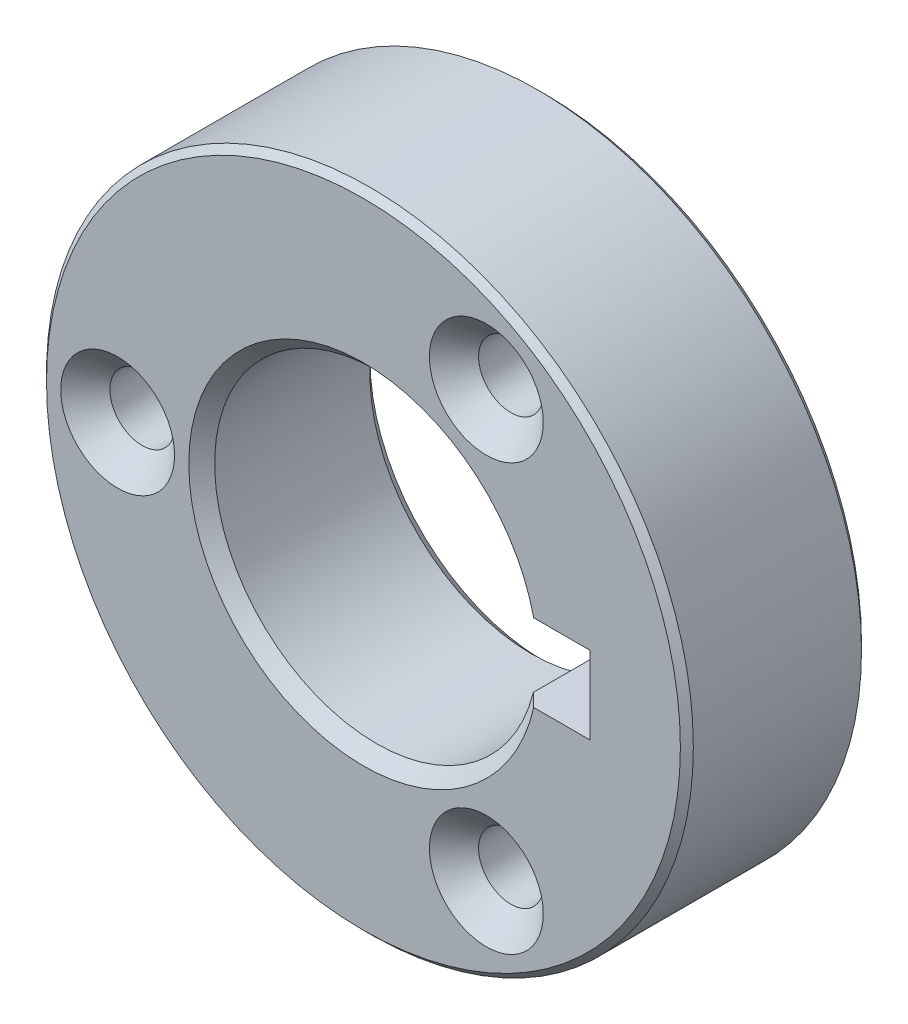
ISO-10303-21;
HEADER;
FILE_DESCRIPTION(('STEP AP214'),'2;1');
FILE_NAME('part.step','',(''),(''),'','','');
FILE_SCHEMA(('AUTOMOTIVE_DESIGN { 1 0 10303 214 1 1 1 1 }'));
ENDSEC;
DATA;
#1=APPLICATION_CONTEXT('core data for automotive mechanical design processes');
#2=APPLICATION_PROTOCOL_DEFINITION('international standard','automotive_design',2000,#1);
#3=PRODUCT_CONTEXT('',#1,'mechanical');
#4=PRODUCT('Part','Part','',(#3));
#5=PRODUCT_RELATED_PRODUCT_CATEGORY('part','',(#4));
#6=PRODUCT_DEFINITION_FORMATION('','',#4);
#7=PRODUCT_DEFINITION_CONTEXT('part definition',#1,'design');
#8=PRODUCT_DEFINITION('design','',#6,#7);
#9=PRODUCT_DEFINITION_SHAPE('','',#8);
#10=(LENGTH_UNIT() NAMED_UNIT(*) SI_UNIT(.MILLI.,.METRE.));
#11=(NAMED_UNIT(*) PLANE_ANGLE_UNIT() SI_UNIT($,.RADIAN.));
#12=(NAMED_UNIT(*) SI_UNIT($,.STERADIAN.) SOLID_ANGLE_UNIT());
#13=UNCERTAINTY_MEASURE_WITH_UNIT(LENGTH_MEASURE(1.E-05),#10,'distance_accuracy_value','');
#14=(GEOMETRIC_REPRESENTATION_CONTEXT(3) GLOBAL_UNCERTAINTY_ASSIGNED_CONTEXT((#13)) GLOBAL_UNIT_ASSIGNED_CONTEXT((#10,
#11,#12)) REPRESENTATION_CONTEXT('',''));
#15=CARTESIAN_POINT('',(0.,0.,0.));
#16=DIRECTION('',(0.,0.,1.));
#17=DIRECTION('',(1.,0.,0.));
#18=AXIS2_PLACEMENT_3D('',#15,#16,#17);
#19=CARTESIAN_POINT('',(0.,0.,14.));
#20=DIRECTION('',(0.,0.,1.));
#21=DIRECTION('',(1.,0.,0.));
#22=AXIS2_PLACEMENT_3D('',#19,#20,#21);
#23=PLANE('',#22);
#24=CARTESIAN_POINT('',(-19.,0.,14.0000000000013));
#25=DIRECTION('',(0.,0.,1.));
#26=DIRECTION('',(1.,0.,0.));
#27=AXIS2_PLACEMENT_3D('',#24,#25,#26);
#28=CIRCLE('',#27,4.4);
#29=CARTESIAN_POINT('',(-14.6,0.,14.0000000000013));
#30=VERTEX_POINT('',#29);
#31=EDGE_CURVE('E113',#30,#30,#28,.T.);
#32=ORIENTED_EDGE('',*,*,#31,.F.);
#33=EDGE_LOOP('',(#32));
#34=FACE_BOUND('',#33,.T.);
#35=CARTESIAN_POINT('',(9.50000000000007,16.4544826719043,14.));
#36=DIRECTION('',(0.,0.,1.));
#37=DIRECTION('',(1.,0.,0.));
#38=AXIS2_PLACEMENT_3D('',#35,#36,#37);
#39=CIRCLE('',#38,4.4);
#40=CARTESIAN_POINT('',(13.9000000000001,16.4544826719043,14.));
#41=VERTEX_POINT('',#40);
#42=EDGE_CURVE('E106',#41,#41,#39,.T.);
#43=ORIENTED_EDGE('',*,*,#42,.F.);
#44=EDGE_LOOP('',(#43));
#45=FACE_BOUND('',#44,.T.);
#46=CARTESIAN_POINT('',(9.49999999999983,-16.4544826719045,14.));
#47=DIRECTION('',(0.,0.,1.));
#48=DIRECTION('',(1.,0.,0.));
#49=AXIS2_PLACEMENT_3D('',#46,#47,#48);
#50=CIRCLE('',#49,4.4);
#51=CARTESIAN_POINT('',(13.8999999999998,-16.4544826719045,14.));
#52=VERTEX_POINT('',#51);
#53=EDGE_CURVE('E122',#52,#52,#50,.T.);
#54=ORIENTED_EDGE('',*,*,#53,.F.);
#55=EDGE_LOOP('',(#54));
#56=FACE_BOUND('',#55,.T.);
#57=CARTESIAN_POINT('',(0.,0.,14.));
#58=DIRECTION('',(0.,0.,1.));
#59=DIRECTION('',(1.,0.,0.));
#60=AXIS2_PLACEMENT_3D('',#57,#58,#59);
#61=CIRCLE('',#60,24.5);
#62=CARTESIAN_POINT('',(24.5,0.,14.));
#63=VERTEX_POINT('',#62);
#64=EDGE_CURVE('E164',#63,#63,#61,.T.);
#65=ORIENTED_EDGE('',*,*,#64,.T.);
#66=EDGE_LOOP('',(#65));
#67=FACE_BOUND('',#66,.T.);
#68=DIRECTION('',(1.,0.,0.));
#69=VECTOR('',#68,1.);
#70=CARTESIAN_POINT('',(12.1346610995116,-3.,14.));
#71=LINE('',#70,#69);
#72=CARTESIAN_POINT('',(13.1624465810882,-3.,14.));
#73=VERTEX_POINT('',#72);
#74=CARTESIAN_POINT('',(17.5,-3.,14.));
#75=VERTEX_POINT('',#74);
#76=EDGE_CURVE('E138',#73,#75,#71,.T.);
#77=ORIENTED_EDGE('',*,*,#76,.F.);
#78=CARTESIAN_POINT('',(0.,0.,14.));
#79=DIRECTION('',(0.,0.,1.));
#80=DIRECTION('',(1.,0.,0.));
#81=AXIS2_PLACEMENT_3D('',#78,#79,#80);
#82=CIRCLE('',#81,13.5);
#83=CARTESIAN_POINT('',(13.1624465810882,3.,14.));
#84=VERTEX_POINT('',#83);
#85=EDGE_CURVE('E55',#73,#84,#82,.F.);
#86=ORIENTED_EDGE('',*,*,#85,.T.);
#87=DIRECTION('',(-1.,0.,0.));
#88=VECTOR('',#87,1.);
#89=CARTESIAN_POINT('',(12.1346610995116,3.,14.));
#90=LINE('',#89,#88);
#91=CARTESIAN_POINT('',(17.5,3.,14.));
#92=VERTEX_POINT('',#91);
#93=EDGE_CURVE('E143',#92,#84,#90,.T.);
#94=ORIENTED_EDGE('',*,*,#93,.F.);
#95=DIRECTION('',(0.,1.,0.));
#96=VECTOR('',#95,1.);
#97=CARTESIAN_POINT('',(17.5,3.,14.));
#98=LINE('',#97,#96);
#99=EDGE_CURVE('E140',#75,#92,#98,.T.);
#100=ORIENTED_EDGE('',*,*,#99,.F.);
#101=EDGE_LOOP('',(#77,#86,#94,#100));
#102=FACE_BOUND('',#101,.T.);
#103=ADVANCED_FACE('F32',(#34,#45,#56,#67,#102),#23,.T.);
#104=CARTESIAN_POINT('',(0.,0.,0.));
#105=DIRECTION('',(0.,0.,1.));
#106=DIRECTION('',(1.,0.,0.));
#107=AXIS2_PLACEMENT_3D('',#104,#105,#106);
#108=PLANE('',#107);
#109=CARTESIAN_POINT('',(0.,0.,0.));
#110=DIRECTION('',(0.,0.,1.));
#111=DIRECTION('',(1.,0.,0.));
#112=AXIS2_PLACEMENT_3D('',#109,#110,#111);
#113=CIRCLE('',#112,24.5);
#114=CARTESIAN_POINT('',(24.5,0.,0.));
#115=VERTEX_POINT('',#114);
#116=EDGE_CURVE('E161',#115,#115,#113,.F.);
#117=ORIENTED_EDGE('',*,*,#116,.T.);
#118=EDGE_LOOP('',(#117));
#119=FACE_BOUND('',#118,.T.);
#120=DIRECTION('',(-1.,0.,0.));
#121=VECTOR('',#120,1.);
#122=CARTESIAN_POINT('',(12.1346610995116,3.,0.));
#123=LINE('',#122,#121);
#124=CARTESIAN_POINT('',(17.5,3.,0.));
#125=VERTEX_POINT('',#124);
#126=CARTESIAN_POINT('',(13.1624465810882,3.,0.));
#127=VERTEX_POINT('',#126);
#128=EDGE_CURVE('E136',#125,#127,#123,.T.);
#129=ORIENTED_EDGE('',*,*,#128,.T.);
#130=CARTESIAN_POINT('',(0.,0.,0.));
#131=DIRECTION('',(0.,0.,1.));
#132=DIRECTION('',(1.,0.,0.));
#133=AXIS2_PLACEMENT_3D('',#130,#131,#132);
#134=CIRCLE('',#133,13.5);
#135=CARTESIAN_POINT('',(13.1624465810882,-3.,0.));
#136=VERTEX_POINT('',#135);
#137=EDGE_CURVE('E11',#127,#136,#134,.T.);
#138=ORIENTED_EDGE('',*,*,#137,.T.);
#139=DIRECTION('',(1.,0.,0.));
#140=VECTOR('',#139,1.);
#141=CARTESIAN_POINT('',(12.1346610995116,-3.00000000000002,0.));
#142=LINE('',#141,#140);
#143=CARTESIAN_POINT('',(17.5,-3.,0.));
#144=VERTEX_POINT('',#143);
#145=EDGE_CURVE('E131',#136,#144,#142,.T.);
#146=ORIENTED_EDGE('',*,*,#145,.T.);
#147=DIRECTION('',(0.,1.,0.));
#148=VECTOR('',#147,1.);
#149=CARTESIAN_POINT('',(17.5,3.,0.));
#150=LINE('',#149,#148);
#151=EDGE_CURVE('E133',#144,#125,#150,.T.);
#152=ORIENTED_EDGE('',*,*,#151,.T.);
#153=EDGE_LOOP('',(#129,#138,#146,#152));
#154=FACE_BOUND('',#153,.T.);
#155=ADVANCED_FACE('F224',(#119,#154),#108,.F.);
#156=CARTESIAN_POINT('',(0.,0.,14.));
#157=DIRECTION('',(0.,0.,-1.));
#158=DIRECTION('',(-1.,0.,0.));
#159=AXIS2_PLACEMENT_3D('',#156,#157,#158);
#160=CYLINDRICAL_SURFACE('',#159,25.);
#161=CARTESIAN_POINT('',(0.,0.,0.5));
#162=DIRECTION('',(0.,0.,1.));
#163=DIRECTION('',(1.,0.,0.));
#164=AXIS2_PLACEMENT_3D('',#161,#162,#163);
#165=CIRCLE('',#164,25.);
#166=CARTESIAN_POINT('',(25.,0.,0.5));
#167=VERTEX_POINT('',#166);
#168=EDGE_CURVE('E158',#167,#167,#165,.T.);
#169=ORIENTED_EDGE('',*,*,#168,.T.);
#170=EDGE_LOOP('',(#169));
#171=FACE_BOUND('',#170,.T.);
#172=CARTESIAN_POINT('',(0.,0.,13.5));
#173=DIRECTION('',(0.,0.,1.));
#174=DIRECTION('',(1.,0.,0.));
#175=AXIS2_PLACEMENT_3D('',#172,#173,#174);
#176=CIRCLE('',#175,25.);
#177=CARTESIAN_POINT('',(25.,0.,13.5));
#178=VERTEX_POINT('',#177);
#179=EDGE_CURVE('E155',#178,#178,#176,.F.);
#180=ORIENTED_EDGE('',*,*,#179,.T.);
#181=EDGE_LOOP('',(#180));
#182=FACE_BOUND('',#181,.T.);
#183=ADVANCED_FACE('F34',(#171,#182),#160,.T.);
#184=CARTESIAN_POINT('',(0.,0.,14.));
#185=DIRECTION('',(0.,0.,-1.));
#186=DIRECTION('',(-1.,0.,0.));
#187=AXIS2_PLACEMENT_3D('',#184,#185,#186);
#188=CYLINDRICAL_SURFACE('',#187,12.5);
#189=DIRECTION('',(0.,0.,-1.));
#190=VECTOR('',#189,1.);
#191=CARTESIAN_POINT('',(12.1346610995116,3.,14.));
#192=LINE('',#191,#190);
#193=CARTESIAN_POINT('',(12.1346610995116,3.,13.));
#194=VERTEX_POINT('',#193);
#195=CARTESIAN_POINT('',(12.1346610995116,3.,1.));
#196=VERTEX_POINT('',#195);
#197=EDGE_CURVE('E145',#194,#196,#192,.T.);
#198=ORIENTED_EDGE('',*,*,#197,.F.);
#199=CARTESIAN_POINT('',(0.,0.,13.));
#200=DIRECTION('',(0.,0.,1.));
#201=DIRECTION('',(1.,0.,0.));
#202=AXIS2_PLACEMENT_3D('',#199,#200,#201);
#203=CIRCLE('',#202,12.5);
#204=CARTESIAN_POINT('',(12.1346610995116,-3.00000000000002,13.));
#205=VERTEX_POINT('',#204);
#206=EDGE_CURVE('E169',#194,#205,#203,.T.);
#207=ORIENTED_EDGE('',*,*,#206,.T.);
#208=DIRECTION('',(0.,0.,-1.));
#209=VECTOR('',#208,1.);
#210=CARTESIAN_POINT('',(12.1346610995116,-3.,14.));
#211=LINE('',#210,#209);
#212=CARTESIAN_POINT('',(12.1346610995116,-3.00000000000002,1.));
#213=VERTEX_POINT('',#212);
#214=EDGE_CURVE('E152',#205,#213,#211,.T.);
#215=ORIENTED_EDGE('',*,*,#214,.T.);
#216=CARTESIAN_POINT('',(0.,0.,1.));
#217=DIRECTION('',(0.,0.,1.));
#218=DIRECTION('',(1.,0.,0.));
#219=AXIS2_PLACEMENT_3D('',#216,#217,#218);
#220=CIRCLE('',#219,12.5);
#221=EDGE_CURVE('E167',#213,#196,#220,.F.);
#222=ORIENTED_EDGE('',*,*,#221,.T.);
#223=EDGE_LOOP('',(#198,#207,#215,#222));
#224=FACE_BOUND('',#223,.T.);
#225=ADVANCED_FACE('F220',(#224),#188,.F.);
#226=CARTESIAN_POINT('',(12.1346610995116,-3.,14.));
#227=DIRECTION('',(0.,1.,0.));
#228=DIRECTION('',(0.,0.,1.));
#229=AXIS2_PLACEMENT_3D('',#226,#227,#228);
#230=PLANE('',#229);
#231=ORIENTED_EDGE('',*,*,#214,.F.);
#232=CARTESIAN_POINT('',(12.1346610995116,-3.00000000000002,13.));
#233=CARTESIAN_POINT('',(12.3061392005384,-3.00000000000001,13.1664811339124));
#234=CARTESIAN_POINT('',(12.4775270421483,-3.,13.3330550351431));
#235=CARTESIAN_POINT('',(12.8201222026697,-3.,13.6663883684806));
#236=CARTESIAN_POINT('',(12.9913295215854,-3.,13.8331478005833));
#237=CARTESIAN_POINT('',(13.1624465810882,-3.,14.));
#238=B_SPLINE_CURVE_WITH_KNOTS('',3,(#232,#233,#234,#235,#236,#237),.UNSPECIFIED.,.F.,.F.,(4,2,
4),(0.,0.71699784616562,1.43399567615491),.UNSPECIFIED.);
#239=EDGE_CURVE('E179',#205,#73,#238,.T.);
#240=ORIENTED_EDGE('',*,*,#239,.T.);
#241=ORIENTED_EDGE('',*,*,#76,.T.);
#242=DIRECTION('',(0.,0.,-1.));
#243=VECTOR('',#242,1.);
#244=CARTESIAN_POINT('',(17.5,-3.,14.));
#245=LINE('',#244,#243);
#246=EDGE_CURVE('E149',#75,#144,#245,.T.);
#247=ORIENTED_EDGE('',*,*,#246,.T.);
#248=ORIENTED_EDGE('',*,*,#145,.F.);
#249=CARTESIAN_POINT('',(13.1624465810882,-3.,0.));
#250=CARTESIAN_POINT('',(12.9913295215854,-3.,0.166852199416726));
#251=CARTESIAN_POINT('',(12.8201222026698,-3.,0.333611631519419));
#252=CARTESIAN_POINT('',(12.4775270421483,-3.,0.666944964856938));
#253=CARTESIAN_POINT('',(12.3061392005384,-3.00000000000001,0.833518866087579));
#254=CARTESIAN_POINT('',(12.1346610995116,-3.00000000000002,1.));
#255=B_SPLINE_CURVE_WITH_KNOTS('',3,(#249,#250,#251,#252,#253,#254),.UNSPECIFIED.,.F.,.F.,(4,2,
4),(0.,0.716997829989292,1.43399567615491),.UNSPECIFIED.);
#256=EDGE_CURVE('E172',#136,#213,#255,.T.);
#257=ORIENTED_EDGE('',*,*,#256,.T.);
#258=EDGE_LOOP('',(#231,#240,#241,#247,#248,#257));
#259=FACE_BOUND('',#258,.T.);
#260=ADVANCED_FACE('F185',(#259),#230,.T.);
#261=CARTESIAN_POINT('',(17.5,3.,14.));
#262=DIRECTION('',(-1.,0.,0.));
#263=DIRECTION('',(0.,0.,1.));
#264=AXIS2_PLACEMENT_3D('',#261,#262,#263);
#265=PLANE('',#264);
#266=ORIENTED_EDGE('',*,*,#151,.F.);
#267=ORIENTED_EDGE('',*,*,#246,.F.);
#268=ORIENTED_EDGE('',*,*,#99,.T.);
#269=DIRECTION('',(0.,0.,-1.));
#270=VECTOR('',#269,1.);
#271=CARTESIAN_POINT('',(17.5,3.,14.));
#272=LINE('',#271,#270);
#273=EDGE_CURVE('E147',#92,#125,#272,.T.);
#274=ORIENTED_EDGE('',*,*,#273,.T.);
#275=EDGE_LOOP('',(#266,#267,#268,#274));
#276=FACE_BOUND('',#275,.T.);
#277=ADVANCED_FACE('F213',(#276),#265,.T.);
#278=CARTESIAN_POINT('',(12.1346610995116,3.,14.));
#279=DIRECTION('',(0.,-1.,0.));
#280=DIRECTION('',(0.,0.,-1.));
#281=AXIS2_PLACEMENT_3D('',#278,#279,#280);
#282=PLANE('',#281);
#283=ORIENTED_EDGE('',*,*,#93,.T.);
#284=CARTESIAN_POINT('',(13.1624465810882,3.,14.));
#285=CARTESIAN_POINT('',(12.9913295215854,3.,13.8331478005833));
#286=CARTESIAN_POINT('',(12.8201222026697,3.,13.6663883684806));
#287=CARTESIAN_POINT('',(12.4775270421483,3.,13.3330550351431));
#288=CARTESIAN_POINT('',(12.3061392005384,3.,13.1664811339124));
#289=CARTESIAN_POINT('',(12.1346610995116,3.,13.));
#290=B_SPLINE_CURVE_WITH_KNOTS('',3,(#284,#285,#286,#287,#288,#289),.UNSPECIFIED.,.F.,.F.,(4,2,
4),(0.,0.716997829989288,1.4339956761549),.UNSPECIFIED.);
#291=EDGE_CURVE('E40',#84,#194,#290,.T.);
#292=ORIENTED_EDGE('',*,*,#291,.T.);
#293=ORIENTED_EDGE('',*,*,#197,.T.);
#294=CARTESIAN_POINT('',(12.1346610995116,3.,1.));
#295=CARTESIAN_POINT('',(12.3061392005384,3.,0.833518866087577));
#296=CARTESIAN_POINT('',(12.4775270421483,3.,0.666944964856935));
#297=CARTESIAN_POINT('',(12.8201222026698,3.,0.333611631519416));
#298=CARTESIAN_POINT('',(12.9913295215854,3.,0.166852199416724));
#299=CARTESIAN_POINT('',(13.1624465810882,3.,0.));
#300=B_SPLINE_CURVE_WITH_KNOTS('',3,(#294,#295,#296,#297,#298,#299),.UNSPECIFIED.,.F.,.F.,(4,2,
4),(0.,0.716997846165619,1.43399567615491),.UNSPECIFIED.);
#301=EDGE_CURVE('E47',#196,#127,#300,.T.);
#302=ORIENTED_EDGE('',*,*,#301,.T.);
#303=ORIENTED_EDGE('',*,*,#128,.F.);
#304=ORIENTED_EDGE('',*,*,#273,.F.);
#305=EDGE_LOOP('',(#283,#292,#293,#302,#303,#304));
#306=FACE_BOUND('',#305,.T.);
#307=ADVANCED_FACE('F208',(#306),#282,.T.);
#308=CARTESIAN_POINT('',(0.,0.,0.5));
#309=DIRECTION('',(0.,0.,1.));
#310=DIRECTION('',(1.,0.,0.));
#311=AXIS2_PLACEMENT_3D('',#308,#309,#310);
#312=CONICAL_SURFACE('',#311,25.,0.785398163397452);
#313=ORIENTED_EDGE('',*,*,#116,.F.);
#314=EDGE_LOOP('',(#313));
#315=FACE_BOUND('',#314,.T.);
#316=ORIENTED_EDGE('',*,*,#168,.F.);
#317=EDGE_LOOP('',(#316));
#318=FACE_BOUND('',#317,.T.);
#319=ADVANCED_FACE('F212',(#315,#318),#312,.T.);
#320=CARTESIAN_POINT('',(0.,0.,14.));
#321=DIRECTION('',(0.,0.,-1.));
#322=DIRECTION('',(-1.,0.,0.));
#323=AXIS2_PLACEMENT_3D('',#320,#321,#322);
#324=CONICAL_SURFACE('',#323,24.5,0.785398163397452);
#325=ORIENTED_EDGE('',*,*,#179,.F.);
#326=EDGE_LOOP('',(#325));
#327=FACE_BOUND('',#326,.T.);
#328=ORIENTED_EDGE('',*,*,#64,.F.);
#329=EDGE_LOOP('',(#328));
#330=FACE_BOUND('',#329,.T.);
#331=ADVANCED_FACE('F251',(#327,#330),#324,.T.);
#332=CARTESIAN_POINT('',(0.,0.,13.));
#333=DIRECTION('',(0.,0.,1.));
#334=DIRECTION('',(1.,0.,0.));
#335=AXIS2_PLACEMENT_3D('',#332,#333,#334);
#336=CONICAL_SURFACE('',#335,12.5,0.785398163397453);
#337=ORIENTED_EDGE('',*,*,#291,.F.);
#338=ORIENTED_EDGE('',*,*,#85,.F.);
#339=ORIENTED_EDGE('',*,*,#239,.F.);
#340=ORIENTED_EDGE('',*,*,#206,.F.);
#341=EDGE_LOOP('',(#337,#338,#339,#340));
#342=FACE_BOUND('',#341,.T.);
#343=ADVANCED_FACE('F194',(#342),#336,.F.);
#344=CARTESIAN_POINT('',(0.,0.,0.));
#345=DIRECTION('',(0.,0.,-1.));
#346=DIRECTION('',(-1.,0.,0.));
#347=AXIS2_PLACEMENT_3D('',#344,#345,#346);
#348=CONICAL_SURFACE('',#347,13.5,0.785398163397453);
#349=ORIENTED_EDGE('',*,*,#301,.F.);
#350=ORIENTED_EDGE('',*,*,#221,.F.);
#351=ORIENTED_EDGE('',*,*,#256,.F.);
#352=ORIENTED_EDGE('',*,*,#137,.F.);
#353=EDGE_LOOP('',(#349,#350,#351,#352));
#354=FACE_BOUND('',#353,.T.);
#355=ADVANCED_FACE('F189',(#354),#348,.F.);
#356=CARTESIAN_POINT('',(9.49999999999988,-16.4544826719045,8.00000000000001));
#357=DIRECTION('',(0.,0.,1.));
#358=DIRECTION('',(1.,0.,0.));
#359=AXIS2_PLACEMENT_3D('',#356,#357,#358);
#360=CONICAL_SURFACE('',#359,2.5,1.02974425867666);
#361=CARTESIAN_POINT('',(9.49999999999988,-16.4544826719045,6.49784845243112));
#362=VERTEX_POINT('',#361);
#363=VERTEX_LOOP('',#362);
#364=FACE_BOUND('',#363,.T.);
#365=CARTESIAN_POINT('',(9.49999999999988,-16.4544826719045,8.00000000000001));
#366=DIRECTION('',(0.,0.,1.));
#367=DIRECTION('',(1.,0.,0.));
#368=AXIS2_PLACEMENT_3D('',#365,#366,#367);
#369=CIRCLE('',#368,2.5);
#370=CARTESIAN_POINT('',(11.9999999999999,-16.4544826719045,8.00000000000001));
#371=VERTEX_POINT('',#370);
#372=EDGE_CURVE('E128',#371,#371,#369,.T.);
#373=ORIENTED_EDGE('',*,*,#372,.T.);
#374=EDGE_LOOP('',(#373));
#375=FACE_BOUND('',#374,.T.);
#376=ADVANCED_FACE('F193',(#364,#375),#360,.F.);
#377=CARTESIAN_POINT('',(9.49999999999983,-16.4544826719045,14.));
#378=DIRECTION('',(0.,0.,1.));
#379=DIRECTION('',(1.,0.,0.));
#380=AXIS2_PLACEMENT_3D('',#377,#378,#379);
#381=CYLINDRICAL_SURFACE('',#380,2.5);
#382=ORIENTED_EDGE('',*,*,#372,.F.);
#383=EDGE_LOOP('',(#382));
#384=FACE_BOUND('',#383,.T.);
#385=CARTESIAN_POINT('',(9.49999999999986,-16.4544826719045,12.1));
#386=DIRECTION('',(0.,0.,1.));
#387=DIRECTION('',(1.,0.,0.));
#388=AXIS2_PLACEMENT_3D('',#385,#386,#387);
#389=CIRCLE('',#388,2.5);
#390=CARTESIAN_POINT('',(11.9999999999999,-16.4544826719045,12.1));
#391=VERTEX_POINT('',#390);
#392=EDGE_CURVE('E125',#391,#391,#389,.T.);
#393=ORIENTED_EDGE('',*,*,#392,.T.);
#394=EDGE_LOOP('',(#393));
#395=FACE_BOUND('',#394,.T.);
#396=ADVANCED_FACE('F329',(#384,#395),#381,.F.);
#397=CARTESIAN_POINT('',(9.49999999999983,-16.4544826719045,14.));
#398=DIRECTION('',(0.,0.,1.));
#399=DIRECTION('',(1.,0.,0.));
#400=AXIS2_PLACEMENT_3D('',#397,#398,#399);
#401=CONICAL_SURFACE('',#400,4.4,0.785398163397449);
#402=ORIENTED_EDGE('',*,*,#392,.F.);
#403=EDGE_LOOP('',(#402));
#404=FACE_BOUND('',#403,.T.);
#405=ORIENTED_EDGE('',*,*,#53,.T.);
#406=EDGE_LOOP('',(#405));
#407=FACE_BOUND('',#406,.T.);
#408=ADVANCED_FACE('F337',(#404,#407),#401,.F.);
#409=CARTESIAN_POINT('',(9.5000000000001,16.4544826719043,8.00000000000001));
#410=DIRECTION('',(0.,0.,1.));
#411=DIRECTION('',(1.,0.,0.));
#412=AXIS2_PLACEMENT_3D('',#409,#410,#411);
#413=CONICAL_SURFACE('',#412,2.5,1.02974425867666);
#414=CARTESIAN_POINT('',(9.50000000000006,16.4544826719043,6.49784845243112));
#415=VERTEX_POINT('',#414);
#416=VERTEX_LOOP('',#415);
#417=FACE_BOUND('',#416,.T.);
#418=CARTESIAN_POINT('',(9.5000000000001,16.4544826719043,8.00000000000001));
#419=DIRECTION('',(0.,0.,1.));
#420=DIRECTION('',(1.,0.,0.));
#421=AXIS2_PLACEMENT_3D('',#418,#419,#420);
#422=CIRCLE('',#421,2.5);
#423=CARTESIAN_POINT('',(12.0000000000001,16.4544826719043,8.00000000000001));
#424=VERTEX_POINT('',#423);
#425=EDGE_CURVE('E119',#424,#424,#422,.T.);
#426=ORIENTED_EDGE('',*,*,#425,.T.);
#427=EDGE_LOOP('',(#426));
#428=FACE_BOUND('',#427,.T.);
#429=ADVANCED_FACE('F345',(#417,#428),#413,.F.);
#430=CARTESIAN_POINT('',(9.50000000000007,16.4544826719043,14.));
#431=DIRECTION('',(0.,0.,1.));
#432=DIRECTION('',(1.,0.,0.));
#433=AXIS2_PLACEMENT_3D('',#430,#431,#432);
#434=CYLINDRICAL_SURFACE('',#433,2.5);
#435=ORIENTED_EDGE('',*,*,#425,.F.);
#436=EDGE_LOOP('',(#435));
#437=FACE_BOUND('',#436,.T.);
#438=CARTESIAN_POINT('',(9.50000000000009,16.4544826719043,12.1));
#439=DIRECTION('',(0.,0.,1.));
#440=DIRECTION('',(1.,0.,0.));
#441=AXIS2_PLACEMENT_3D('',#438,#439,#440);
#442=CIRCLE('',#441,2.5);
#443=CARTESIAN_POINT('',(12.0000000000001,16.4544826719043,12.1));
#444=VERTEX_POINT('',#443);
#445=EDGE_CURVE('E110',#444,#444,#442,.T.);
#446=ORIENTED_EDGE('',*,*,#445,.T.);
#447=EDGE_LOOP('',(#446));
#448=FACE_BOUND('',#447,.T.);
#449=ADVANCED_FACE('F354',(#437,#448),#434,.F.);
#450=CARTESIAN_POINT('',(9.50000000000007,16.4544826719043,14.));
#451=DIRECTION('',(0.,0.,1.));
#452=DIRECTION('',(1.,0.,0.));
#453=AXIS2_PLACEMENT_3D('',#450,#451,#452);
#454=CONICAL_SURFACE('',#453,4.4,0.785398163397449);
#455=ORIENTED_EDGE('',*,*,#445,.F.);
#456=EDGE_LOOP('',(#455));
#457=FACE_BOUND('',#456,.T.);
#458=ORIENTED_EDGE('',*,*,#42,.T.);
#459=EDGE_LOOP('',(#458));
#460=FACE_BOUND('',#459,.T.);
#461=ADVANCED_FACE('F100',(#457,#460),#454,.F.);
#462=CARTESIAN_POINT('',(-19.,0.,8.00000000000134));
#463=DIRECTION('',(0.,0.,1.));
#464=DIRECTION('',(1.,0.,0.));
#465=AXIS2_PLACEMENT_3D('',#462,#463,#464);
#466=CONICAL_SURFACE('',#465,2.5,1.02974425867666);
#467=CARTESIAN_POINT('',(-19.,0.,6.4978484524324));
#468=VERTEX_POINT('',#467);
#469=VERTEX_LOOP('',#468);
#470=FACE_BOUND('',#469,.T.);
#471=CARTESIAN_POINT('',(-19.,0.,8.00000000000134));
#472=DIRECTION('',(0.,0.,1.));
#473=DIRECTION('',(1.,0.,0.));
#474=AXIS2_PLACEMENT_3D('',#471,#472,#473);
#475=CIRCLE('',#474,2.5);
#476=CARTESIAN_POINT('',(-16.5,0.,8.00000000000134));
#477=VERTEX_POINT('',#476);
#478=EDGE_CURVE('E104',#477,#477,#475,.T.);
#479=ORIENTED_EDGE('',*,*,#478,.T.);
#480=EDGE_LOOP('',(#479));
#481=FACE_BOUND('',#480,.T.);
#482=ADVANCED_FACE('F96',(#470,#481),#466,.F.);
#483=CARTESIAN_POINT('',(-19.,0.,14.0000000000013));
#484=DIRECTION('',(0.,0.,1.));
#485=DIRECTION('',(1.,0.,0.));
#486=AXIS2_PLACEMENT_3D('',#483,#484,#485);
#487=CYLINDRICAL_SURFACE('',#486,2.5);
#488=ORIENTED_EDGE('',*,*,#478,.F.);
#489=EDGE_LOOP('',(#488));
#490=FACE_BOUND('',#489,.T.);
#491=CARTESIAN_POINT('',(-19.,0.,12.1000000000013));
#492=DIRECTION('',(0.,0.,1.));
#493=DIRECTION('',(1.,0.,0.));
#494=AXIS2_PLACEMENT_3D('',#491,#492,#493);
#495=CIRCLE('',#494,2.5);
#496=CARTESIAN_POINT('',(-16.5,0.,12.1000000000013));
#497=VERTEX_POINT('',#496);
#498=EDGE_CURVE('E107',#497,#497,#495,.T.);
#499=ORIENTED_EDGE('',*,*,#498,.T.);
#500=EDGE_LOOP('',(#499));
#501=FACE_BOUND('',#500,.T.);
#502=ADVANCED_FACE('F99',(#490,#501),#487,.F.);
#503=CARTESIAN_POINT('',(-19.,0.,14.0000000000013));
#504=DIRECTION('',(0.,0.,1.));
#505=DIRECTION('',(1.,0.,0.));
#506=AXIS2_PLACEMENT_3D('',#503,#504,#505);
#507=CONICAL_SURFACE('',#506,4.4,0.78539816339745);
#508=ORIENTED_EDGE('',*,*,#498,.F.);
#509=EDGE_LOOP('',(#508));
#510=FACE_BOUND('',#509,.T.);
#511=ORIENTED_EDGE('',*,*,#31,.T.);
#512=EDGE_LOOP('',(#511));
#513=FACE_BOUND('',#512,.T.);
#514=ADVANCED_FACE('F384',(#510,#513),#507,.F.);
#515=CLOSED_SHELL('',(#103,#155,#183,#225,#260,#277,#307,#319,#331,#343,#355,#376,#396,#408,
#429,#449,#461,#482,#502,#514));
#516=MANIFOLD_SOLID_BREP('B2',#515);
#517=ADVANCED_BREP_SHAPE_REPRESENTATION('',(#18,#516),#14);
#518=SHAPE_DEFINITION_REPRESENTATION(#9,#517);
ENDSEC;
END-ISO-10303-21;
